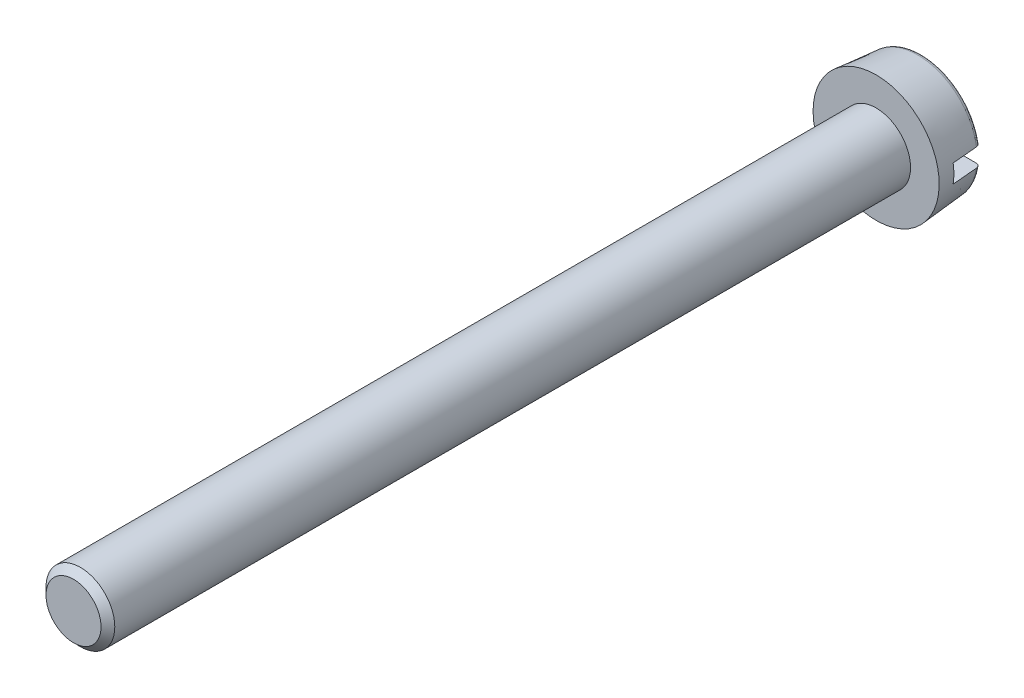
from build123d import *

# Parameters (mm, degrees)
ESQUISSE3_W             = 1.5
ESQUISSE3_H             = 35
ESQUISSE2_W             = 5.5
ESQUISSE2_H             = 0.8
ENLEV_MAT_EXTRU_1_DEPTH = 1.3
CHANFREIN1_SIZE         = 0.3


with BuildPart() as part:
    # Esquisse3 → Boss.-R_vol.1 (revolve)
    with BuildSketch(Plane(origin=(0, 0, 0), x_dir=(1, 0, 0), z_dir=(0, 1, 0))):
        with Locations((0.75, -17.5)):
            Rectangle(ESQUISSE3_W, ESQUISSE3_H)
    revolve(axis=Axis((0, 0, 0), (0, 0, 1)))

    # Esquisse1 → Base-R_volution (revolve)
    with BuildSketch(Plane(origin=(0, 0, 0), x_dir=(1, 0, 0), z_dir=(0, 1, 0))):
        with BuildLine():
            Line((0, 0), (2.75, 0))
            Line((2.75, 0), (2.590995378, 1.817431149))
            ThreePointArc((2.590995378, 1.817431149), (2.52687448, 1.947455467), (2.391756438, 2))
            Line((2.391756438, 2), (0, 2))
            Line((0, 2), (0, 0))
        make_face()
    revolve(axis=Axis((0, 0, 0), (0, 0, -1)))

    # Esquisse2 → Enlev. mat.-Extru.1 (cut)
    with BuildSketch(Plane.XY.offset(-2)):
        Rectangle(ESQUISSE2_W, ESQUISSE2_H)
    extrude(amount=ENLEV_MAT_EXTRU_1_DEPTH, mode=Mode.SUBTRACT)

    # Chanfrein1
    chanfrein1_edges = [part.edges().sort_by_distance(p)[0] for p in [
        (-1.5, 0, 35),
    ]]
    chamfer(chanfrein1_edges, length=CHANFREIN1_SIZE)


solid = part.part
